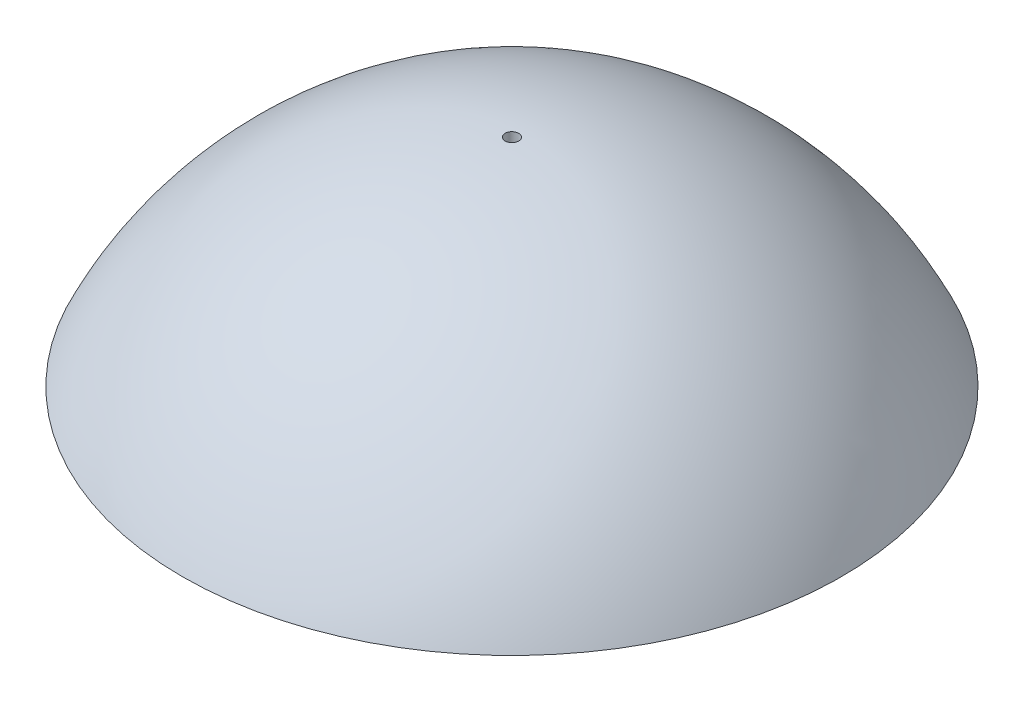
from build123d import *

# Parameters (mm, degrees)
SKETCH4_R          = 2.4892
CUT_EXTRUDE2_DEPTH = 182.778115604


with BuildPart() as part:
    # Sketch2 → Revolve1 (revolve)
    with BuildSketch(Plane(origin=(0, 0, 0), x_dir=(0, 0, -1), z_dir=(1, 0, 0))):
        with BuildLine():
            Line((0, 59.384767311), (0, 56.209767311))
            ThreePointArc((0, 56.209767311), (-57.192817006, 41.371156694), (-99.378478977, 0))
            Line((-99.378478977, 0), (-103.124, 0))
            ThreePointArc((-103.124, 0), (-112.756148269, -9.683395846), (-121.482653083, -20.190276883))
            add(Edge.make_bspline(
                [(-121.482653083, -20.190276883), (-99.889768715, 26.004612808), (-52.553556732, 59.89016451), (0, 59.384767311)],
                knots=[0, 0, 0, 0, 1, 1, 1, 1], degree=3))
        make_face()
    revolve(axis=Axis((0, 0, 0), (0, -1, 0)))

    # Sketch4 → Cut-Extrude2 (cut, through all)
    with BuildSketch(Plane.XZ):
        with Locations(Location((0, 0, 0), (0, 0, 90))):
            Circle(SKETCH4_R)
    extrude(amount=-CUT_EXTRUDE2_DEPTH, mode=Mode.SUBTRACT)

    # Sketch5 → Revolve2 (revolve)
    with BuildSketch(Plane.XY, mode=Mode.PRIVATE) as revolve2_sk:
        Polygon((2.4892, 46.5827454), (47.792472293, 46.5827454), (33.095250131, 53.802309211), (2.4892, 57.923519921), align=None)
    revolve(revolve2_sk.sketch.rotate(Axis((0, 0, 0), (0, 1, 0)), 270), axis=Axis((0, 0, 0), (0, 1, 0)))


solid = part.part
